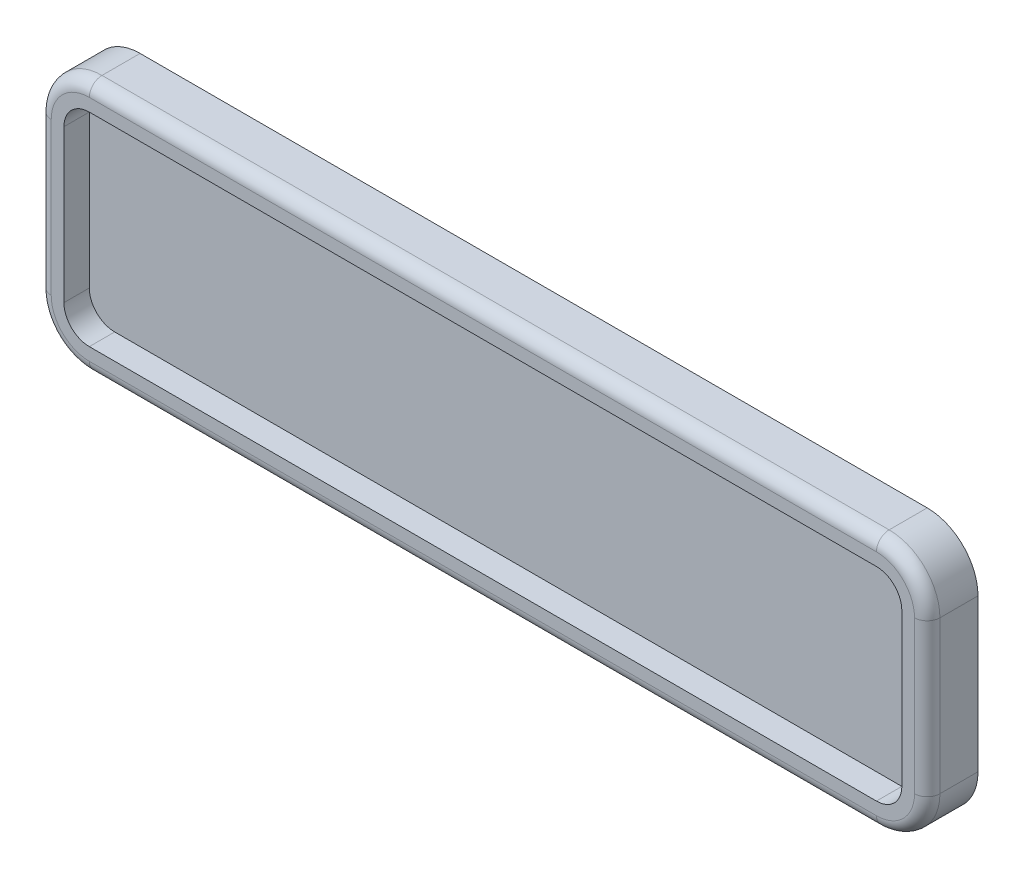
ISO-10303-21;
HEADER;
FILE_DESCRIPTION(('STEP AP214'),'2;1');
FILE_NAME('part.step','',(''),(''),'','','');
FILE_SCHEMA(('AUTOMOTIVE_DESIGN { 1 0 10303 214 1 1 1 1 }'));
ENDSEC;
DATA;
#1=APPLICATION_CONTEXT('core data for automotive mechanical design processes');
#2=APPLICATION_PROTOCOL_DEFINITION('international standard','automotive_design',2000,#1);
#3=PRODUCT_CONTEXT('',#1,'mechanical');
#4=PRODUCT('Part','Part','',(#3));
#5=PRODUCT_RELATED_PRODUCT_CATEGORY('part','',(#4));
#6=PRODUCT_DEFINITION_FORMATION('','',#4);
#7=PRODUCT_DEFINITION_CONTEXT('part definition',#1,'design');
#8=PRODUCT_DEFINITION('design','',#6,#7);
#9=PRODUCT_DEFINITION_SHAPE('','',#8);
#10=(LENGTH_UNIT() NAMED_UNIT(*) SI_UNIT(.MILLI.,.METRE.));
#11=(NAMED_UNIT(*) PLANE_ANGLE_UNIT() SI_UNIT($,.RADIAN.));
#12=(NAMED_UNIT(*) SI_UNIT($,.STERADIAN.) SOLID_ANGLE_UNIT());
#13=UNCERTAINTY_MEASURE_WITH_UNIT(LENGTH_MEASURE(1.E-05),#10,'distance_accuracy_value','');
#14=(GEOMETRIC_REPRESENTATION_CONTEXT(3) GLOBAL_UNCERTAINTY_ASSIGNED_CONTEXT((#13)) GLOBAL_UNIT_ASSIGNED_CONTEXT((#10,
#11,#12)) REPRESENTATION_CONTEXT('',''));
#15=CARTESIAN_POINT('',(0.,0.,0.));
#16=DIRECTION('',(0.,0.,1.));
#17=DIRECTION('',(1.,0.,0.));
#18=AXIS2_PLACEMENT_3D('',#15,#16,#17);
#19=CARTESIAN_POINT('',(33.,8.,2.));
#20=DIRECTION('',(0.,0.,-1.));
#21=DIRECTION('',(-1.,0.,0.));
#22=AXIS2_PLACEMENT_3D('',#19,#20,#21);
#23=CYLINDRICAL_SURFACE('',#22,2.);
#24=DIRECTION('',(0.,0.,-1.));
#25=VECTOR('',#24,1.);
#26=CARTESIAN_POINT('',(33.,10.,2.));
#27=LINE('',#26,#25);
#28=CARTESIAN_POINT('',(33.,10.,1.5));
#29=VERTEX_POINT('',#28);
#30=CARTESIAN_POINT('',(33.,10.,0.));
#31=VERTEX_POINT('',#30);
#32=EDGE_CURVE('E283',#29,#31,#27,.T.);
#33=ORIENTED_EDGE('',*,*,#32,.F.);
#34=CARTESIAN_POINT('',(33.,8.,1.5));
#35=DIRECTION('',(0.,0.,-1.));
#36=DIRECTION('',(-1.,0.,0.));
#37=AXIS2_PLACEMENT_3D('',#34,#35,#36);
#38=CIRCLE('',#37,2.);
#39=CARTESIAN_POINT('',(35.,7.99999999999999,1.5));
#40=VERTEX_POINT('',#39);
#41=EDGE_CURVE('E307',#29,#40,#38,.T.);
#42=ORIENTED_EDGE('',*,*,#41,.T.);
#43=DIRECTION('',(0.,0.,-1.));
#44=VECTOR('',#43,1.);
#45=CARTESIAN_POINT('',(35.,7.99999999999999,2.));
#46=LINE('',#45,#44);
#47=CARTESIAN_POINT('',(35.,7.99999999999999,0.));
#48=VERTEX_POINT('',#47);
#49=EDGE_CURVE('E269',#40,#48,#46,.T.);
#50=ORIENTED_EDGE('',*,*,#49,.T.);
#51=CARTESIAN_POINT('',(33.,8.,0.));
#52=DIRECTION('',(0.,0.,1.));
#53=DIRECTION('',(-1.,0.,0.));
#54=AXIS2_PLACEMENT_3D('',#51,#52,#53);
#55=CIRCLE('',#54,2.);
#56=EDGE_CURVE('E234',#48,#31,#55,.T.);
#57=ORIENTED_EDGE('',*,*,#56,.T.);
#58=EDGE_LOOP('',(#33,#42,#50,#57));
#59=FACE_BOUND('',#58,.T.);
#60=ADVANCED_FACE('F33',(#59),#23,.T.);
#61=CARTESIAN_POINT('',(2.00000000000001,10.,2.));
#62=DIRECTION('',(0.,-1.,0.));
#63=DIRECTION('',(0.,0.,-1.));
#64=AXIS2_PLACEMENT_3D('',#61,#62,#63);
#65=PLANE('',#64);
#66=DIRECTION('',(0.,0.,-1.));
#67=VECTOR('',#66,1.);
#68=CARTESIAN_POINT('',(2.00000000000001,10.,2.));
#69=LINE('',#68,#67);
#70=CARTESIAN_POINT('',(2.00000000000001,10.,1.5));
#71=VERTEX_POINT('',#70);
#72=CARTESIAN_POINT('',(2.00000000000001,10.,0.));
#73=VERTEX_POINT('',#72);
#74=EDGE_CURVE('E281',#71,#73,#69,.T.);
#75=ORIENTED_EDGE('',*,*,#74,.F.);
#76=DIRECTION('',(-1.,0.,0.));
#77=VECTOR('',#76,1.);
#78=CARTESIAN_POINT('',(2.00000000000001,10.,1.5));
#79=LINE('',#78,#77);
#80=EDGE_CURVE('E11',#71,#29,#79,.F.);
#81=ORIENTED_EDGE('',*,*,#80,.T.);
#82=ORIENTED_EDGE('',*,*,#32,.T.);
#83=DIRECTION('',(-1.,0.,0.));
#84=VECTOR('',#83,1.);
#85=CARTESIAN_POINT('',(2.00000000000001,10.,0.));
#86=LINE('',#85,#84);
#87=EDGE_CURVE('E248',#31,#73,#86,.T.);
#88=ORIENTED_EDGE('',*,*,#87,.T.);
#89=EDGE_LOOP('',(#75,#81,#82,#88));
#90=FACE_BOUND('',#89,.T.);
#91=ADVANCED_FACE('F349',(#90),#65,.F.);
#92=CARTESIAN_POINT('',(2.,8.,2.));
#93=DIRECTION('',(0.,0.,-1.));
#94=DIRECTION('',(-1.,0.,0.));
#95=AXIS2_PLACEMENT_3D('',#92,#93,#94);
#96=CYLINDRICAL_SURFACE('',#95,2.);
#97=DIRECTION('',(0.,0.,-1.));
#98=VECTOR('',#97,1.);
#99=CARTESIAN_POINT('',(0.,7.99999999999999,2.));
#100=LINE('',#99,#98);
#101=CARTESIAN_POINT('',(0.,7.99999999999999,1.5));
#102=VERTEX_POINT('',#101);
#103=CARTESIAN_POINT('',(0.,7.99999999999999,0.));
#104=VERTEX_POINT('',#103);
#105=EDGE_CURVE('E279',#102,#104,#100,.T.);
#106=ORIENTED_EDGE('',*,*,#105,.F.);
#107=CARTESIAN_POINT('',(2.,8.,1.5));
#108=DIRECTION('',(0.,0.,-1.));
#109=DIRECTION('',(-1.,0.,0.));
#110=AXIS2_PLACEMENT_3D('',#107,#108,#109);
#111=CIRCLE('',#110,2.);
#112=EDGE_CURVE('E42',#102,#71,#111,.T.);
#113=ORIENTED_EDGE('',*,*,#112,.T.);
#114=ORIENTED_EDGE('',*,*,#74,.T.);
#115=CARTESIAN_POINT('',(2.,8.,0.));
#116=DIRECTION('',(0.,0.,1.));
#117=DIRECTION('',(-1.,0.,0.));
#118=AXIS2_PLACEMENT_3D('',#115,#116,#117);
#119=CIRCLE('',#118,2.);
#120=EDGE_CURVE('E251',#73,#104,#119,.T.);
#121=ORIENTED_EDGE('',*,*,#120,.T.);
#122=EDGE_LOOP('',(#106,#113,#114,#121));
#123=FACE_BOUND('',#122,.T.);
#124=ADVANCED_FACE('F361',(#123),#96,.T.);
#125=CARTESIAN_POINT('',(0.,2.00000000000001,2.));
#126=DIRECTION('',(1.,0.,0.));
#127=DIRECTION('',(0.,0.,-1.));
#128=AXIS2_PLACEMENT_3D('',#125,#126,#127);
#129=PLANE('',#128);
#130=DIRECTION('',(0.,0.,-1.));
#131=VECTOR('',#130,1.);
#132=CARTESIAN_POINT('',(0.,2.00000000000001,2.));
#133=LINE('',#132,#131);
#134=CARTESIAN_POINT('',(0.,2.00000000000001,1.5));
#135=VERTEX_POINT('',#134);
#136=CARTESIAN_POINT('',(0.,2.00000000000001,0.));
#137=VERTEX_POINT('',#136);
#138=EDGE_CURVE('E277',#135,#137,#133,.T.);
#139=ORIENTED_EDGE('',*,*,#138,.F.);
#140=DIRECTION('',(0.,-1.,0.));
#141=VECTOR('',#140,1.);
#142=CARTESIAN_POINT('',(0.,2.00000000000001,1.5));
#143=LINE('',#142,#141);
#144=EDGE_CURVE('E57',#135,#102,#143,.F.);
#145=ORIENTED_EDGE('',*,*,#144,.T.);
#146=ORIENTED_EDGE('',*,*,#105,.T.);
#147=DIRECTION('',(0.,-1.,0.));
#148=VECTOR('',#147,1.);
#149=CARTESIAN_POINT('',(0.,2.00000000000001,0.));
#150=LINE('',#149,#148);
#151=EDGE_CURVE('E254',#104,#137,#150,.T.);
#152=ORIENTED_EDGE('',*,*,#151,.T.);
#153=EDGE_LOOP('',(#139,#145,#146,#152));
#154=FACE_BOUND('',#153,.T.);
#155=ADVANCED_FACE('F362',(#154),#129,.F.);
#156=CARTESIAN_POINT('',(2.,2.,2.));
#157=DIRECTION('',(0.,0.,-1.));
#158=DIRECTION('',(-1.,0.,0.));
#159=AXIS2_PLACEMENT_3D('',#156,#157,#158);
#160=CYLINDRICAL_SURFACE('',#159,2.);
#161=DIRECTION('',(0.,0.,-1.));
#162=VECTOR('',#161,1.);
#163=CARTESIAN_POINT('',(2.00000000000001,0.,2.));
#164=LINE('',#163,#162);
#165=CARTESIAN_POINT('',(2.00000000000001,0.,1.5));
#166=VERTEX_POINT('',#165);
#167=CARTESIAN_POINT('',(2.00000000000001,0.,0.));
#168=VERTEX_POINT('',#167);
#169=EDGE_CURVE('E275',#166,#168,#164,.T.);
#170=ORIENTED_EDGE('',*,*,#169,.F.);
#171=CARTESIAN_POINT('',(2.,2.,1.5));
#172=DIRECTION('',(0.,0.,-1.));
#173=DIRECTION('',(-1.,0.,0.));
#174=AXIS2_PLACEMENT_3D('',#171,#172,#173);
#175=CIRCLE('',#174,2.);
#176=EDGE_CURVE('E311',#166,#135,#175,.T.);
#177=ORIENTED_EDGE('',*,*,#176,.T.);
#178=ORIENTED_EDGE('',*,*,#138,.T.);
#179=CARTESIAN_POINT('',(2.,2.,0.));
#180=DIRECTION('',(0.,0.,1.));
#181=DIRECTION('',(-1.,0.,0.));
#182=AXIS2_PLACEMENT_3D('',#179,#180,#181);
#183=CIRCLE('',#182,2.);
#184=EDGE_CURVE('E257',#137,#168,#183,.T.);
#185=ORIENTED_EDGE('',*,*,#184,.T.);
#186=EDGE_LOOP('',(#170,#177,#178,#185));
#187=FACE_BOUND('',#186,.T.);
#188=ADVANCED_FACE('F366',(#187),#160,.T.);
#189=CARTESIAN_POINT('',(2.00000000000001,0.,2.));
#190=DIRECTION('',(0.,1.,0.));
#191=DIRECTION('',(0.,0.,1.));
#192=AXIS2_PLACEMENT_3D('',#189,#190,#191);
#193=PLANE('',#192);
#194=DIRECTION('',(0.,0.,-1.));
#195=VECTOR('',#194,1.);
#196=CARTESIAN_POINT('',(33.,0.,2.));
#197=LINE('',#196,#195);
#198=CARTESIAN_POINT('',(33.,0.,1.5));
#199=VERTEX_POINT('',#198);
#200=CARTESIAN_POINT('',(33.,0.,0.));
#201=VERTEX_POINT('',#200);
#202=EDGE_CURVE('E273',#199,#201,#197,.T.);
#203=ORIENTED_EDGE('',*,*,#202,.F.);
#204=DIRECTION('',(1.,0.,0.));
#205=VECTOR('',#204,1.);
#206=CARTESIAN_POINT('',(2.00000000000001,0.,1.5));
#207=LINE('',#206,#205);
#208=EDGE_CURVE('E309',#199,#166,#207,.F.);
#209=ORIENTED_EDGE('',*,*,#208,.T.);
#210=ORIENTED_EDGE('',*,*,#169,.T.);
#211=DIRECTION('',(1.,0.,0.));
#212=VECTOR('',#211,1.);
#213=CARTESIAN_POINT('',(2.00000000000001,0.,0.));
#214=LINE('',#213,#212);
#215=EDGE_CURVE('E260',#168,#201,#214,.T.);
#216=ORIENTED_EDGE('',*,*,#215,.T.);
#217=EDGE_LOOP('',(#203,#209,#210,#216));
#218=FACE_BOUND('',#217,.T.);
#219=ADVANCED_FACE('F418',(#218),#193,.F.);
#220=CARTESIAN_POINT('',(33.,2.,2.));
#221=DIRECTION('',(0.,0.,-1.));
#222=DIRECTION('',(-1.,0.,0.));
#223=AXIS2_PLACEMENT_3D('',#220,#221,#222);
#224=CYLINDRICAL_SURFACE('',#223,2.);
#225=DIRECTION('',(0.,0.,-1.));
#226=VECTOR('',#225,1.);
#227=CARTESIAN_POINT('',(35.,2.,2.));
#228=LINE('',#227,#226);
#229=CARTESIAN_POINT('',(35.,2.,1.5));
#230=VERTEX_POINT('',#229);
#231=CARTESIAN_POINT('',(35.,2.,0.));
#232=VERTEX_POINT('',#231);
#233=EDGE_CURVE('E271',#230,#232,#228,.T.);
#234=ORIENTED_EDGE('',*,*,#233,.F.);
#235=CARTESIAN_POINT('',(33.,2.,1.5));
#236=DIRECTION('',(0.,0.,-1.));
#237=DIRECTION('',(-1.,0.,0.));
#238=AXIS2_PLACEMENT_3D('',#235,#236,#237);
#239=CIRCLE('',#238,2.);
#240=EDGE_CURVE('E302',#230,#199,#239,.T.);
#241=ORIENTED_EDGE('',*,*,#240,.T.);
#242=ORIENTED_EDGE('',*,*,#202,.T.);
#243=CARTESIAN_POINT('',(33.,2.,0.));
#244=DIRECTION('',(0.,0.,1.));
#245=DIRECTION('',(1.,0.,0.));
#246=AXIS2_PLACEMENT_3D('',#243,#244,#245);
#247=CIRCLE('',#246,2.);
#248=EDGE_CURVE('E263',#201,#232,#247,.T.);
#249=ORIENTED_EDGE('',*,*,#248,.T.);
#250=EDGE_LOOP('',(#234,#241,#242,#249));
#251=FACE_BOUND('',#250,.T.);
#252=ADVANCED_FACE('F395',(#251),#224,.T.);
#253=CARTESIAN_POINT('',(35.,2.00000000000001,2.));
#254=DIRECTION('',(-1.,0.,0.));
#255=DIRECTION('',(0.,0.,1.));
#256=AXIS2_PLACEMENT_3D('',#253,#254,#255);
#257=PLANE('',#256);
#258=ORIENTED_EDGE('',*,*,#49,.F.);
#259=DIRECTION('',(0.,1.,0.));
#260=VECTOR('',#259,1.);
#261=CARTESIAN_POINT('',(35.,2.00000000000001,1.5));
#262=LINE('',#261,#260);
#263=EDGE_CURVE('E305',#40,#230,#262,.F.);
#264=ORIENTED_EDGE('',*,*,#263,.T.);
#265=ORIENTED_EDGE('',*,*,#233,.T.);
#266=DIRECTION('',(0.,1.,0.));
#267=VECTOR('',#266,1.);
#268=CARTESIAN_POINT('',(35.,2.00000000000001,0.));
#269=LINE('',#268,#267);
#270=EDGE_CURVE('E266',#232,#48,#269,.T.);
#271=ORIENTED_EDGE('',*,*,#270,.T.);
#272=EDGE_LOOP('',(#258,#264,#265,#271));
#273=FACE_BOUND('',#272,.T.);
#274=ADVANCED_FACE('F392',(#273),#257,.F.);
#275=CARTESIAN_POINT('',(33.,8.,2.));
#276=DIRECTION('',(0.,0.,-1.));
#277=DIRECTION('',(-1.,0.,0.));
#278=AXIS2_PLACEMENT_3D('',#275,#276,#277);
#279=PLANE('',#278);
#280=DIRECTION('',(1.,0.,0.));
#281=VECTOR('',#280,1.);
#282=CARTESIAN_POINT('',(33.,0.5,2.));
#283=LINE('',#282,#281);
#284=CARTESIAN_POINT('',(2.00000000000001,0.5,2.));
#285=VERTEX_POINT('',#284);
#286=CARTESIAN_POINT('',(33.,0.5,2.));
#287=VERTEX_POINT('',#286);
#288=EDGE_CURVE('E293',#285,#287,#283,.T.);
#289=ORIENTED_EDGE('',*,*,#288,.T.);
#290=CARTESIAN_POINT('',(33.,2.,2.));
#291=DIRECTION('',(0.,0.,-1.));
#292=DIRECTION('',(-1.,0.,0.));
#293=AXIS2_PLACEMENT_3D('',#290,#291,#292);
#294=CIRCLE('',#293,1.5);
#295=CARTESIAN_POINT('',(34.5,2.,2.));
#296=VERTEX_POINT('',#295);
#297=EDGE_CURVE('E299',#287,#296,#294,.F.);
#298=ORIENTED_EDGE('',*,*,#297,.T.);
#299=DIRECTION('',(0.,1.,0.));
#300=VECTOR('',#299,1.);
#301=CARTESIAN_POINT('',(34.5,8.,2.));
#302=LINE('',#301,#300);
#303=CARTESIAN_POINT('',(34.5,7.99999999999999,2.));
#304=VERTEX_POINT('',#303);
#305=EDGE_CURVE('E297',#296,#304,#302,.T.);
#306=ORIENTED_EDGE('',*,*,#305,.T.);
#307=CARTESIAN_POINT('',(33.,8.,2.));
#308=DIRECTION('',(0.,0.,-1.));
#309=DIRECTION('',(-1.,0.,0.));
#310=AXIS2_PLACEMENT_3D('',#307,#308,#309);
#311=CIRCLE('',#310,1.5);
#312=CARTESIAN_POINT('',(33.,9.5,2.));
#313=VERTEX_POINT('',#312);
#314=EDGE_CURVE('E295',#304,#313,#311,.F.);
#315=ORIENTED_EDGE('',*,*,#314,.T.);
#316=DIRECTION('',(-1.,0.,0.));
#317=VECTOR('',#316,1.);
#318=CARTESIAN_POINT('',(33.,9.5,2.));
#319=LINE('',#318,#317);
#320=CARTESIAN_POINT('',(2.00000000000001,9.5,2.));
#321=VERTEX_POINT('',#320);
#322=EDGE_CURVE('E285',#313,#321,#319,.T.);
#323=ORIENTED_EDGE('',*,*,#322,.T.);
#324=CARTESIAN_POINT('',(2.,8.,2.));
#325=DIRECTION('',(0.,0.,-1.));
#326=DIRECTION('',(-1.,0.,0.));
#327=AXIS2_PLACEMENT_3D('',#324,#325,#326);
#328=CIRCLE('',#327,1.5);
#329=CARTESIAN_POINT('',(0.5,7.99999999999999,2.));
#330=VERTEX_POINT('',#329);
#331=EDGE_CURVE('E287',#321,#330,#328,.F.);
#332=ORIENTED_EDGE('',*,*,#331,.T.);
#333=DIRECTION('',(0.,-1.,0.));
#334=VECTOR('',#333,1.);
#335=CARTESIAN_POINT('',(0.5,8.,2.));
#336=LINE('',#335,#334);
#337=CARTESIAN_POINT('',(0.5,2.00000000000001,2.));
#338=VERTEX_POINT('',#337);
#339=EDGE_CURVE('E289',#330,#338,#336,.T.);
#340=ORIENTED_EDGE('',*,*,#339,.T.);
#341=CARTESIAN_POINT('',(2.,2.,2.));
#342=DIRECTION('',(0.,0.,-1.));
#343=DIRECTION('',(-1.,0.,0.));
#344=AXIS2_PLACEMENT_3D('',#341,#342,#343);
#345=CIRCLE('',#344,1.5);
#346=EDGE_CURVE('E291',#338,#285,#345,.F.);
#347=ORIENTED_EDGE('',*,*,#346,.T.);
#348=EDGE_LOOP('',(#289,#298,#306,#315,#323,#332,#340,#347));
#349=FACE_BOUND('',#348,.T.);
#350=DIRECTION('',(-1.,0.,0.));
#351=VECTOR('',#350,1.);
#352=CARTESIAN_POINT('',(33.,9.,2.));
#353=LINE('',#352,#351);
#354=CARTESIAN_POINT('',(33.,9.,2.));
#355=VERTEX_POINT('',#354);
#356=CARTESIAN_POINT('',(2.00000000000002,9.,2.));
#357=VERTEX_POINT('',#356);
#358=EDGE_CURVE('E216',#355,#357,#353,.T.);
#359=ORIENTED_EDGE('',*,*,#358,.F.);
#360=CARTESIAN_POINT('',(33.,8.,2.));
#361=DIRECTION('',(0.,0.,1.));
#362=DIRECTION('',(1.,0.,0.));
#363=AXIS2_PLACEMENT_3D('',#360,#361,#362);
#364=CIRCLE('',#363,1.);
#365=CARTESIAN_POINT('',(34.,7.99999999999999,2.));
#366=VERTEX_POINT('',#365);
#367=EDGE_CURVE('E178',#366,#355,#364,.T.);
#368=ORIENTED_EDGE('',*,*,#367,.F.);
#369=DIRECTION('',(0.,1.,0.));
#370=VECTOR('',#369,1.);
#371=CARTESIAN_POINT('',(34.,2.,2.));
#372=LINE('',#371,#370);
#373=CARTESIAN_POINT('',(34.,2.,2.));
#374=VERTEX_POINT('',#373);
#375=EDGE_CURVE('E196',#374,#366,#372,.T.);
#376=ORIENTED_EDGE('',*,*,#375,.F.);
#377=CARTESIAN_POINT('',(33.,2.,2.));
#378=DIRECTION('',(0.,0.,1.));
#379=DIRECTION('',(1.,0.,0.));
#380=AXIS2_PLACEMENT_3D('',#377,#378,#379);
#381=CIRCLE('',#380,1.);
#382=CARTESIAN_POINT('',(33.,1.,2.));
#383=VERTEX_POINT('',#382);
#384=EDGE_CURVE('E199',#383,#374,#381,.T.);
#385=ORIENTED_EDGE('',*,*,#384,.F.);
#386=DIRECTION('',(1.,0.,0.));
#387=VECTOR('',#386,1.);
#388=CARTESIAN_POINT('',(2.00000000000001,1.,2.));
#389=LINE('',#388,#387);
#390=CARTESIAN_POINT('',(2.00000000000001,1.,2.));
#391=VERTEX_POINT('',#390);
#392=EDGE_CURVE('E227',#391,#383,#389,.T.);
#393=ORIENTED_EDGE('',*,*,#392,.F.);
#394=CARTESIAN_POINT('',(2.,2.,2.));
#395=DIRECTION('',(0.,0.,1.));
#396=DIRECTION('',(1.,0.,0.));
#397=AXIS2_PLACEMENT_3D('',#394,#395,#396);
#398=CIRCLE('',#397,1.);
#399=CARTESIAN_POINT('',(1.,2.00000000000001,2.));
#400=VERTEX_POINT('',#399);
#401=EDGE_CURVE('E224',#400,#391,#398,.T.);
#402=ORIENTED_EDGE('',*,*,#401,.F.);
#403=DIRECTION('',(0.,-1.,0.));
#404=VECTOR('',#403,1.);
#405=CARTESIAN_POINT('',(1.,7.99999999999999,2.));
#406=LINE('',#405,#404);
#407=CARTESIAN_POINT('',(0.999999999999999,7.99999999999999,2.));
#408=VERTEX_POINT('',#407);
#409=EDGE_CURVE('E221',#408,#400,#406,.T.);
#410=ORIENTED_EDGE('',*,*,#409,.F.);
#411=CARTESIAN_POINT('',(2.,8.,2.));
#412=DIRECTION('',(0.,0.,1.));
#413=DIRECTION('',(1.,0.,0.));
#414=AXIS2_PLACEMENT_3D('',#411,#412,#413);
#415=CIRCLE('',#414,1.);
#416=EDGE_CURVE('E218',#357,#408,#415,.T.);
#417=ORIENTED_EDGE('',*,*,#416,.F.);
#418=EDGE_LOOP('',(#359,#368,#376,#385,#393,#402,#410,#417));
#419=FACE_BOUND('',#418,.T.);
#420=ADVANCED_FACE('F379',(#349,#419),#279,.F.);
#421=CARTESIAN_POINT('',(33.,8.,0.));
#422=DIRECTION('',(0.,0.,-1.));
#423=DIRECTION('',(-1.,0.,0.));
#424=AXIS2_PLACEMENT_3D('',#421,#422,#423);
#425=PLANE('',#424);
#426=ORIENTED_EDGE('',*,*,#56,.F.);
#427=ORIENTED_EDGE('',*,*,#270,.F.);
#428=ORIENTED_EDGE('',*,*,#248,.F.);
#429=ORIENTED_EDGE('',*,*,#215,.F.);
#430=ORIENTED_EDGE('',*,*,#184,.F.);
#431=ORIENTED_EDGE('',*,*,#151,.F.);
#432=ORIENTED_EDGE('',*,*,#120,.F.);
#433=ORIENTED_EDGE('',*,*,#87,.F.);
#434=EDGE_LOOP('',(#426,#427,#428,#429,#430,#431,#432,#433));
#435=FACE_BOUND('',#434,.T.);
#436=ADVANCED_FACE('F356',(#435),#425,.T.);
#437=CARTESIAN_POINT('',(33.,8.,1.));
#438=DIRECTION('',(0.,0.,1.));
#439=DIRECTION('',(1.,0.,0.));
#440=AXIS2_PLACEMENT_3D('',#437,#438,#439);
#441=CYLINDRICAL_SURFACE('',#440,1.);
#442=ORIENTED_EDGE('',*,*,#367,.T.);
#443=DIRECTION('',(0.,0.,1.));
#444=VECTOR('',#443,1.);
#445=CARTESIAN_POINT('',(33.,9.,1.));
#446=LINE('',#445,#444);
#447=CARTESIAN_POINT('',(33.,9.,1.));
#448=VERTEX_POINT('',#447);
#449=EDGE_CURVE('E171',#448,#355,#446,.T.);
#450=ORIENTED_EDGE('',*,*,#449,.F.);
#451=CARTESIAN_POINT('',(33.,8.,1.));
#452=DIRECTION('',(0.,0.,1.));
#453=DIRECTION('',(1.,0.,0.));
#454=AXIS2_PLACEMENT_3D('',#451,#452,#453);
#455=CIRCLE('',#454,1.);
#456=CARTESIAN_POINT('',(34.,7.99999999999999,1.));
#457=VERTEX_POINT('',#456);
#458=EDGE_CURVE('E175',#457,#448,#455,.T.);
#459=ORIENTED_EDGE('',*,*,#458,.F.);
#460=DIRECTION('',(0.,0.,1.));
#461=VECTOR('',#460,1.);
#462=CARTESIAN_POINT('',(34.,7.99999999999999,1.));
#463=LINE('',#462,#461);
#464=EDGE_CURVE('E232',#457,#366,#463,.T.);
#465=ORIENTED_EDGE('',*,*,#464,.T.);
#466=EDGE_LOOP('',(#442,#450,#459,#465));
#467=FACE_BOUND('',#466,.T.);
#468=ADVANCED_FACE('F173',(#467),#441,.F.);
#469=CARTESIAN_POINT('',(34.,2.,1.));
#470=DIRECTION('',(1.,0.,0.));
#471=DIRECTION('',(0.,0.,-1.));
#472=AXIS2_PLACEMENT_3D('',#469,#470,#471);
#473=PLANE('',#472);
#474=ORIENTED_EDGE('',*,*,#375,.T.);
#475=ORIENTED_EDGE('',*,*,#464,.F.);
#476=DIRECTION('',(0.,1.,0.));
#477=VECTOR('',#476,1.);
#478=CARTESIAN_POINT('',(34.,2.,1.));
#479=LINE('',#478,#477);
#480=CARTESIAN_POINT('',(34.,2.,1.));
#481=VERTEX_POINT('',#480);
#482=EDGE_CURVE('E183',#481,#457,#479,.T.);
#483=ORIENTED_EDGE('',*,*,#482,.F.);
#484=DIRECTION('',(0.,0.,1.));
#485=VECTOR('',#484,1.);
#486=CARTESIAN_POINT('',(34.,2.,1.));
#487=LINE('',#486,#485);
#488=EDGE_CURVE('E235',#481,#374,#487,.T.);
#489=ORIENTED_EDGE('',*,*,#488,.T.);
#490=EDGE_LOOP('',(#474,#475,#483,#489));
#491=FACE_BOUND('',#490,.T.);
#492=ADVANCED_FACE('F432',(#491),#473,.F.);
#493=CARTESIAN_POINT('',(33.,2.,1.));
#494=DIRECTION('',(0.,0.,1.));
#495=DIRECTION('',(1.,0.,0.));
#496=AXIS2_PLACEMENT_3D('',#493,#494,#495);
#497=CYLINDRICAL_SURFACE('',#496,1.);
#498=ORIENTED_EDGE('',*,*,#384,.T.);
#499=ORIENTED_EDGE('',*,*,#488,.F.);
#500=CARTESIAN_POINT('',(33.,2.,1.));
#501=DIRECTION('',(0.,0.,1.));
#502=DIRECTION('',(1.,0.,0.));
#503=AXIS2_PLACEMENT_3D('',#500,#501,#502);
#504=CIRCLE('',#503,1.);
#505=CARTESIAN_POINT('',(33.,1.,1.));
#506=VERTEX_POINT('',#505);
#507=EDGE_CURVE('E212',#506,#481,#504,.T.);
#508=ORIENTED_EDGE('',*,*,#507,.F.);
#509=DIRECTION('',(0.,0.,1.));
#510=VECTOR('',#509,1.);
#511=CARTESIAN_POINT('',(33.,1.,1.));
#512=LINE('',#511,#510);
#513=EDGE_CURVE('E237',#506,#383,#512,.T.);
#514=ORIENTED_EDGE('',*,*,#513,.T.);
#515=EDGE_LOOP('',(#498,#499,#508,#514));
#516=FACE_BOUND('',#515,.T.);
#517=ADVANCED_FACE('F450',(#516),#497,.F.);
#518=CARTESIAN_POINT('',(2.00000000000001,1.,1.));
#519=DIRECTION('',(0.,-1.,0.));
#520=DIRECTION('',(0.,0.,-1.));
#521=AXIS2_PLACEMENT_3D('',#518,#519,#520);
#522=PLANE('',#521);
#523=ORIENTED_EDGE('',*,*,#392,.T.);
#524=ORIENTED_EDGE('',*,*,#513,.F.);
#525=DIRECTION('',(1.,0.,0.));
#526=VECTOR('',#525,1.);
#527=CARTESIAN_POINT('',(2.00000000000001,1.,1.));
#528=LINE('',#527,#526);
#529=CARTESIAN_POINT('',(2.00000000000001,1.,1.));
#530=VERTEX_POINT('',#529);
#531=EDGE_CURVE('E209',#530,#506,#528,.T.);
#532=ORIENTED_EDGE('',*,*,#531,.F.);
#533=DIRECTION('',(0.,0.,1.));
#534=VECTOR('',#533,1.);
#535=CARTESIAN_POINT('',(2.00000000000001,1.,1.));
#536=LINE('',#535,#534);
#537=EDGE_CURVE('E239',#530,#391,#536,.T.);
#538=ORIENTED_EDGE('',*,*,#537,.T.);
#539=EDGE_LOOP('',(#523,#524,#532,#538));
#540=FACE_BOUND('',#539,.T.);
#541=ADVANCED_FACE('F446',(#540),#522,.F.);
#542=CARTESIAN_POINT('',(2.,2.,1.));
#543=DIRECTION('',(0.,0.,1.));
#544=DIRECTION('',(1.,0.,0.));
#545=AXIS2_PLACEMENT_3D('',#542,#543,#544);
#546=CYLINDRICAL_SURFACE('',#545,1.);
#547=ORIENTED_EDGE('',*,*,#401,.T.);
#548=ORIENTED_EDGE('',*,*,#537,.F.);
#549=CARTESIAN_POINT('',(2.,2.,1.));
#550=DIRECTION('',(0.,0.,1.));
#551=DIRECTION('',(1.,0.,0.));
#552=AXIS2_PLACEMENT_3D('',#549,#550,#551);
#553=CIRCLE('',#552,1.);
#554=CARTESIAN_POINT('',(1.,2.00000000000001,1.));
#555=VERTEX_POINT('',#554);
#556=EDGE_CURVE('E206',#555,#530,#553,.T.);
#557=ORIENTED_EDGE('',*,*,#556,.F.);
#558=DIRECTION('',(0.,0.,1.));
#559=VECTOR('',#558,1.);
#560=CARTESIAN_POINT('',(1.,2.00000000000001,1.));
#561=LINE('',#560,#559);
#562=EDGE_CURVE('E241',#555,#400,#561,.T.);
#563=ORIENTED_EDGE('',*,*,#562,.T.);
#564=EDGE_LOOP('',(#547,#548,#557,#563));
#565=FACE_BOUND('',#564,.T.);
#566=ADVANCED_FACE('F442',(#565),#546,.F.);
#567=CARTESIAN_POINT('',(1.,7.99999999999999,1.));
#568=DIRECTION('',(-1.,0.,0.));
#569=DIRECTION('',(0.,0.,1.));
#570=AXIS2_PLACEMENT_3D('',#567,#568,#569);
#571=PLANE('',#570);
#572=ORIENTED_EDGE('',*,*,#409,.T.);
#573=ORIENTED_EDGE('',*,*,#562,.F.);
#574=DIRECTION('',(0.,-1.,0.));
#575=VECTOR('',#574,1.);
#576=CARTESIAN_POINT('',(1.,7.99999999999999,1.));
#577=LINE('',#576,#575);
#578=CARTESIAN_POINT('',(0.999999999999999,7.99999999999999,1.));
#579=VERTEX_POINT('',#578);
#580=EDGE_CURVE('E203',#579,#555,#577,.T.);
#581=ORIENTED_EDGE('',*,*,#580,.F.);
#582=DIRECTION('',(0.,0.,1.));
#583=VECTOR('',#582,1.);
#584=CARTESIAN_POINT('',(0.999999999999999,7.99999999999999,1.));
#585=LINE('',#584,#583);
#586=EDGE_CURVE('E243',#579,#408,#585,.T.);
#587=ORIENTED_EDGE('',*,*,#586,.T.);
#588=EDGE_LOOP('',(#572,#573,#581,#587));
#589=FACE_BOUND('',#588,.T.);
#590=ADVANCED_FACE('F438',(#589),#571,.F.);
#591=CARTESIAN_POINT('',(2.,8.,1.));
#592=DIRECTION('',(0.,0.,1.));
#593=DIRECTION('',(1.,0.,0.));
#594=AXIS2_PLACEMENT_3D('',#591,#592,#593);
#595=CYLINDRICAL_SURFACE('',#594,1.);
#596=ORIENTED_EDGE('',*,*,#416,.T.);
#597=ORIENTED_EDGE('',*,*,#586,.F.);
#598=CARTESIAN_POINT('',(2.,8.,1.));
#599=DIRECTION('',(0.,0.,1.));
#600=DIRECTION('',(1.,0.,0.));
#601=AXIS2_PLACEMENT_3D('',#598,#599,#600);
#602=CIRCLE('',#601,1.);
#603=CARTESIAN_POINT('',(2.00000000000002,9.,1.));
#604=VERTEX_POINT('',#603);
#605=EDGE_CURVE('E191',#604,#579,#602,.T.);
#606=ORIENTED_EDGE('',*,*,#605,.F.);
#607=DIRECTION('',(0.,0.,1.));
#608=VECTOR('',#607,1.);
#609=CARTESIAN_POINT('',(2.00000000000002,9.,1.));
#610=LINE('',#609,#608);
#611=EDGE_CURVE('E182',#604,#357,#610,.T.);
#612=ORIENTED_EDGE('',*,*,#611,.T.);
#613=EDGE_LOOP('',(#596,#597,#606,#612));
#614=FACE_BOUND('',#613,.T.);
#615=ADVANCED_FACE('F435',(#614),#595,.F.);
#616=CARTESIAN_POINT('',(33.,9.,1.));
#617=DIRECTION('',(0.,1.,0.));
#618=DIRECTION('',(0.,0.,1.));
#619=AXIS2_PLACEMENT_3D('',#616,#617,#618);
#620=PLANE('',#619);
#621=ORIENTED_EDGE('',*,*,#358,.T.);
#622=ORIENTED_EDGE('',*,*,#611,.F.);
#623=DIRECTION('',(-1.,0.,0.));
#624=VECTOR('',#623,1.);
#625=CARTESIAN_POINT('',(33.,9.,1.));
#626=LINE('',#625,#624);
#627=EDGE_CURVE('E186',#448,#604,#626,.T.);
#628=ORIENTED_EDGE('',*,*,#627,.F.);
#629=ORIENTED_EDGE('',*,*,#449,.T.);
#630=EDGE_LOOP('',(#621,#622,#628,#629));
#631=FACE_BOUND('',#630,.T.);
#632=ADVANCED_FACE('F187',(#631),#620,.F.);
#633=CARTESIAN_POINT('',(33.,8.,1.));
#634=DIRECTION('',(0.,0.,1.));
#635=DIRECTION('',(1.,0.,0.));
#636=AXIS2_PLACEMENT_3D('',#633,#634,#635);
#637=PLANE('',#636);
#638=ORIENTED_EDGE('',*,*,#458,.T.);
#639=ORIENTED_EDGE('',*,*,#627,.T.);
#640=ORIENTED_EDGE('',*,*,#605,.T.);
#641=ORIENTED_EDGE('',*,*,#580,.T.);
#642=ORIENTED_EDGE('',*,*,#556,.T.);
#643=ORIENTED_EDGE('',*,*,#531,.T.);
#644=ORIENTED_EDGE('',*,*,#507,.T.);
#645=ORIENTED_EDGE('',*,*,#482,.T.);
#646=EDGE_LOOP('',(#638,#639,#640,#641,#642,#643,#644,#645));
#647=FACE_BOUND('',#646,.T.);
#648=ADVANCED_FACE('F193',(#647),#637,.T.);
#649=CARTESIAN_POINT('',(2.,8.,1.5));
#650=DIRECTION('',(0.,0.,-1.));
#651=DIRECTION('',(-1.,0.,0.));
#652=AXIS2_PLACEMENT_3D('',#649,#650,#651);
#653=TOROIDAL_SURFACE('',#652,1.5,0.5);
#654=CARTESIAN_POINT('',(2.00000000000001,9.5,1.5));
#655=DIRECTION('',(1.,0.,0.));
#656=DIRECTION('',(0.,1.,0.));
#657=AXIS2_PLACEMENT_3D('',#654,#655,#656);
#658=CIRCLE('',#657,0.5);
#659=EDGE_CURVE('E330',#71,#321,#658,.T.);
#660=ORIENTED_EDGE('',*,*,#659,.F.);
#661=ORIENTED_EDGE('',*,*,#112,.F.);
#662=CARTESIAN_POINT('',(0.5,7.99999999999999,1.5));
#663=DIRECTION('',(0.,-1.,0.));
#664=DIRECTION('',(0.,0.,-1.));
#665=AXIS2_PLACEMENT_3D('',#662,#663,#664);
#666=CIRCLE('',#665,0.5);
#667=EDGE_CURVE('E37',#330,#102,#666,.T.);
#668=ORIENTED_EDGE('',*,*,#667,.F.);
#669=ORIENTED_EDGE('',*,*,#331,.F.);
#670=EDGE_LOOP('',(#660,#661,#668,#669));
#671=FACE_BOUND('',#670,.T.);
#672=ADVANCED_FACE('F35',(#671),#653,.T.);
#673=CARTESIAN_POINT('',(0.5,8.,1.5));
#674=DIRECTION('',(0.,-1.,0.));
#675=DIRECTION('',(0.,0.,-1.));
#676=AXIS2_PLACEMENT_3D('',#673,#674,#675);
#677=CYLINDRICAL_SURFACE('',#676,0.5);
#678=ORIENTED_EDGE('',*,*,#667,.T.);
#679=ORIENTED_EDGE('',*,*,#144,.F.);
#680=CARTESIAN_POINT('',(0.5,2.00000000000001,1.5));
#681=DIRECTION('',(0.,-1.,0.));
#682=DIRECTION('',(1.,0.,0.));
#683=AXIS2_PLACEMENT_3D('',#680,#681,#682);
#684=CIRCLE('',#683,0.5);
#685=EDGE_CURVE('E328',#338,#135,#684,.T.);
#686=ORIENTED_EDGE('',*,*,#685,.F.);
#687=ORIENTED_EDGE('',*,*,#339,.F.);
#688=EDGE_LOOP('',(#678,#679,#686,#687));
#689=FACE_BOUND('',#688,.T.);
#690=ADVANCED_FACE('F340',(#689),#677,.T.);
#691=CARTESIAN_POINT('',(33.,9.5,1.5));
#692=DIRECTION('',(-1.,0.,0.));
#693=DIRECTION('',(0.,0.,1.));
#694=AXIS2_PLACEMENT_3D('',#691,#692,#693);
#695=CYLINDRICAL_SURFACE('',#694,0.5);
#696=ORIENTED_EDGE('',*,*,#659,.T.);
#697=ORIENTED_EDGE('',*,*,#322,.F.);
#698=CARTESIAN_POINT('',(33.,9.5,1.5));
#699=DIRECTION('',(1.,0.,0.));
#700=DIRECTION('',(0.,0.,-1.));
#701=AXIS2_PLACEMENT_3D('',#698,#699,#700);
#702=CIRCLE('',#701,0.5);
#703=EDGE_CURVE('E325',#29,#313,#702,.T.);
#704=ORIENTED_EDGE('',*,*,#703,.F.);
#705=ORIENTED_EDGE('',*,*,#80,.F.);
#706=EDGE_LOOP('',(#696,#697,#704,#705));
#707=FACE_BOUND('',#706,.T.);
#708=ADVANCED_FACE('F345',(#707),#695,.T.);
#709=CARTESIAN_POINT('',(2.,2.,1.5));
#710=DIRECTION('',(0.,0.,-1.));
#711=DIRECTION('',(-1.,0.,0.));
#712=AXIS2_PLACEMENT_3D('',#709,#710,#711);
#713=TOROIDAL_SURFACE('',#712,1.5,0.5);
#714=ORIENTED_EDGE('',*,*,#685,.T.);
#715=ORIENTED_EDGE('',*,*,#176,.F.);
#716=CARTESIAN_POINT('',(2.00000000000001,0.5,1.5));
#717=DIRECTION('',(1.,0.,0.));
#718=DIRECTION('',(0.,0.,-1.));
#719=AXIS2_PLACEMENT_3D('',#716,#717,#718);
#720=CIRCLE('',#719,0.5);
#721=EDGE_CURVE('E322',#285,#166,#720,.T.);
#722=ORIENTED_EDGE('',*,*,#721,.F.);
#723=ORIENTED_EDGE('',*,*,#346,.F.);
#724=EDGE_LOOP('',(#714,#715,#722,#723));
#725=FACE_BOUND('',#724,.T.);
#726=ADVANCED_FACE('F370',(#725),#713,.T.);
#727=CARTESIAN_POINT('',(33.,8.,1.5));
#728=DIRECTION('',(0.,0.,-1.));
#729=DIRECTION('',(-1.,0.,0.));
#730=AXIS2_PLACEMENT_3D('',#727,#728,#729);
#731=TOROIDAL_SURFACE('',#730,1.5,0.5);
#732=ORIENTED_EDGE('',*,*,#703,.T.);
#733=ORIENTED_EDGE('',*,*,#314,.F.);
#734=CARTESIAN_POINT('',(34.5,7.99999999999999,1.5));
#735=DIRECTION('',(0.,-1.,0.));
#736=DIRECTION('',(0.,0.,-1.));
#737=AXIS2_PLACEMENT_3D('',#734,#735,#736);
#738=CIRCLE('',#737,0.5);
#739=EDGE_CURVE('E319',#40,#304,#738,.T.);
#740=ORIENTED_EDGE('',*,*,#739,.F.);
#741=ORIENTED_EDGE('',*,*,#41,.F.);
#742=EDGE_LOOP('',(#732,#733,#740,#741));
#743=FACE_BOUND('',#742,.T.);
#744=ADVANCED_FACE('F383',(#743),#731,.T.);
#745=CARTESIAN_POINT('',(33.,0.5,1.5));
#746=DIRECTION('',(1.,0.,0.));
#747=DIRECTION('',(0.,0.,-1.));
#748=AXIS2_PLACEMENT_3D('',#745,#746,#747);
#749=CYLINDRICAL_SURFACE('',#748,0.5);
#750=ORIENTED_EDGE('',*,*,#721,.T.);
#751=ORIENTED_EDGE('',*,*,#208,.F.);
#752=CARTESIAN_POINT('',(33.,0.5,1.5));
#753=DIRECTION('',(1.,0.,0.));
#754=DIRECTION('',(0.,1.,0.));
#755=AXIS2_PLACEMENT_3D('',#752,#753,#754);
#756=CIRCLE('',#755,0.5);
#757=EDGE_CURVE('E317',#287,#199,#756,.T.);
#758=ORIENTED_EDGE('',*,*,#757,.F.);
#759=ORIENTED_EDGE('',*,*,#288,.F.);
#760=EDGE_LOOP('',(#750,#751,#758,#759));
#761=FACE_BOUND('',#760,.T.);
#762=ADVANCED_FACE('F375',(#761),#749,.T.);
#763=CARTESIAN_POINT('',(34.5,8.,1.5));
#764=DIRECTION('',(0.,1.,0.));
#765=DIRECTION('',(0.,0.,1.));
#766=AXIS2_PLACEMENT_3D('',#763,#764,#765);
#767=CYLINDRICAL_SURFACE('',#766,0.5);
#768=ORIENTED_EDGE('',*,*,#739,.T.);
#769=ORIENTED_EDGE('',*,*,#305,.F.);
#770=CARTESIAN_POINT('',(34.5,2.,1.5));
#771=DIRECTION('',(0.,-1.,0.));
#772=DIRECTION('',(0.,0.,-1.));
#773=AXIS2_PLACEMENT_3D('',#770,#771,#772);
#774=CIRCLE('',#773,0.5);
#775=EDGE_CURVE('E315',#230,#296,#774,.T.);
#776=ORIENTED_EDGE('',*,*,#775,.F.);
#777=ORIENTED_EDGE('',*,*,#263,.F.);
#778=EDGE_LOOP('',(#768,#769,#776,#777));
#779=FACE_BOUND('',#778,.T.);
#780=ADVANCED_FACE('F389',(#779),#767,.T.);
#781=CARTESIAN_POINT('',(33.,2.,1.5));
#782=DIRECTION('',(0.,0.,-1.));
#783=DIRECTION('',(-1.,0.,0.));
#784=AXIS2_PLACEMENT_3D('',#781,#782,#783);
#785=TOROIDAL_SURFACE('',#784,1.5,0.5);
#786=ORIENTED_EDGE('',*,*,#757,.T.);
#787=ORIENTED_EDGE('',*,*,#240,.F.);
#788=ORIENTED_EDGE('',*,*,#775,.T.);
#789=ORIENTED_EDGE('',*,*,#297,.F.);
#790=EDGE_LOOP('',(#786,#787,#788,#789));
#791=FACE_BOUND('',#790,.T.);
#792=ADVANCED_FACE('F398',(#791),#785,.T.);
#793=CLOSED_SHELL('',(#60,#91,#124,#155,#188,#219,#252,#274,#420,#436,#468,#492,#517,#541,#566,
#590,#615,#632,#648,#672,#690,#708,#726,#744,#762,#780,#792));
#794=MANIFOLD_SOLID_BREP('B2',#793);
#795=ADVANCED_BREP_SHAPE_REPRESENTATION('',(#18,#794),#14);
#796=SHAPE_DEFINITION_REPRESENTATION(#9,#795);
ENDSEC;
END-ISO-10303-21;
